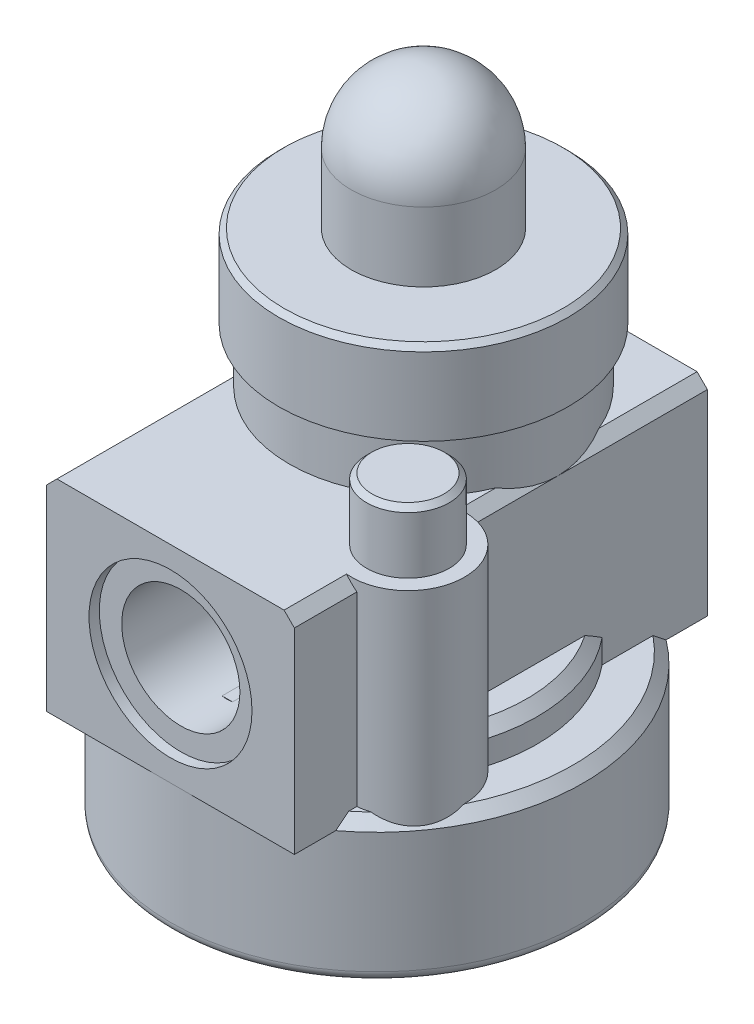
from build123d import *

# Parameters (mm, degrees)
EXTRUDE_1_DEPTH      = 20
EXTRUDE_1_DEPTH_BACK = 20


with BuildPart() as part:
    # Sketch 1 → Extrude 1 (new, two sides: drawn at the far end of the back side and taken through both)
    with BuildSketch(Plane.XY.offset(-EXTRUDE_1_DEPTH_BACK)):
        Polygon((-12, 31.7), (-12, 12.7), (12, 12.7), (12, 31.7), (11, 32.7), (-11, 32.7), align=None)
    extrude(amount=EXTRUDE_1_DEPTH + EXTRUDE_1_DEPTH_BACK)

    # Sketch 2 → Revolve 1 (revolve)
    with BuildSketch(Plane(origin=(11.5, 0, 0), x_dir=(0, 0, -1), z_dir=(1, 0, 0)), mode=Mode.PRIVATE) as revolve_1_sk:
        Polygon((-8.5, 12.7), (-13.975, 12.7), (-13.975, 32.7), (-12.5, 32.7), (-12.5, 38.2), (-12, 38.7), (-8.5, 38.7), align=None)
    revolve(revolve_1_sk.sketch.rotate(Axis((11.5, 38.7, 8.5), (0, -1, 0)), 180), axis=Axis((11.5, 38.7, 8.5), (0, -1, 0)))

    # Sketch 3 → Revolve 2 (revolve)
    with BuildSketch(Plane(origin=(-1, 0, 0), x_dir=(0, 0, -1), z_dir=(1, 0, 0)), mode=Mode.PRIVATE) as revolve_2_sk:
        with BuildLine():
            Line((12.5, 52.7), (12.5, 46))
            Line((12.5, 46), (19, 46))
            Line((19, 46), (19.5, 45.5))
            Line((19.5, 45.5), (19.5, 38))
            Line((19.5, 38), (18.5, 38))
            Line((18.5, 38), (18.5, 12.7))
            Line((18.5, 12.7), (5.5, 12.7))
            Line((5.5, 12.7), (5.5, 59.7))
            ThreePointArc((5.5, 59.7), (10.449747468, 57.649747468), (12.5, 52.7))
        make_face()
    revolve(revolve_2_sk.sketch.rotate(Axis((-1, 12.7, -5.5), (0, 1, 0)), 180), axis=Axis((-1, 12.7, -5.5), (0, 1, 0)))

    # Sketch 4 → Cut-Revolve 1 (revolve, cut)
    with BuildSketch(Plane(origin=(0, 22.7, 0), x_dir=(1, 0, 0), z_dir=(0, 1, 0)), mode=Mode.PRIVATE) as cut_revolve_1_sk:
        Polygon((0, 10), (-5.7225, 10), (-5.7225, 19), (-7.8942, 19), (-7.8942, 20), (0, 20), align=None)
    revolve(cut_revolve_1_sk.sketch.rotate(Axis((0, 22.7, -20), (0, 0, 1)), 180), axis=Axis((0, 22.7, -20), (0, 0, 1)), mode=Mode.SUBTRACT)

    # Sketch 5 → Cut-Revolve 2 (revolve, cut)
    with BuildSketch(Plane(origin=(0, 22.7, 0), x_dir=(1, 0, 0), z_dir=(0, 1, 0)), mode=Mode.PRIVATE) as cut_revolve_2_sk:
        Polygon((0, -20), (-7.8942, -20), (-7.8942, -19), (-5.7225, -19), (-5.7225, -10), (0, -10), align=None)
    revolve(cut_revolve_2_sk.sketch.rotate(Axis((0, 22.7, 10), (0, 0, 1)), 180), axis=Axis((0, 22.7, 10), (0, 0, 1)), mode=Mode.SUBTRACT)

    # Sketch 6 → Revolve 3 (revolve)
    with BuildSketch(Plane.XY, mode=Mode.PRIVATE) as revolve_3_sk:
        with BuildLine():
            Line((0, 5.7), (-18, 5.7))
            Line((-18, 5.7), (-18, 0))
            Line((-18, 0), (-19, 0))
            ThreePointArc((-19, 0), (-19.707106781, 0.292893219), (-20, 1))
            Line((-20, 1), (-20, 12.7))
            Line((-20, 12.7), (-19, 13.7))
            Line((-19, 13.7), (-15.5, 13.7))
            Line((-15.5, 13.7), (-15.5, 16))
            Line((-15.5, 16), (-14.5, 17))
            Line((-14.5, 17), (0, 17))
            Line((0, 17), (0, 5.7))
        make_face()
    revolve(revolve_3_sk.sketch.rotate(Axis((0, 17, 0), (0, -1, 0)), 90), axis=Axis((0, 17, 0), (0, -1, 0)))


solid = part.part
